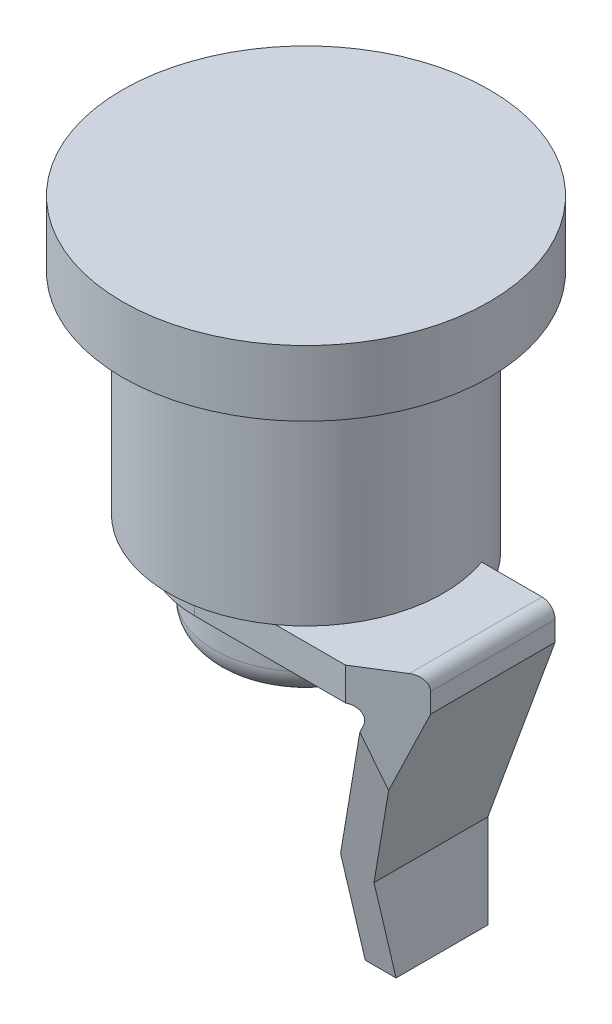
from build123d import *

# Parameters (mm, degrees)
SKETCH1_R           = 14
BOSS_EXTRUDE1_DEPTH = 5
SKETCH2_R           = 10.5
BOSS_EXTRUDE2_DEPTH = 16
SKETCH3_R           = 8.5
BOSS_EXTRUDE3_DEPTH = 2.5
SKETCH4_R           = 7
BOSS_EXTRUDE4_DEPTH = 5
FILLET1_R           = 2
BOSS_EXTRUDE5_START = -2.5
BOSS_EXTRUDE5_DEPTH = 2.5
BOSS_EXTRUDE7_DEPTH = 17
FILLET3_R           = 1
CUT_EXTRUDE1_REACH  = 53.435
CUT_EXTRUDE2_DEPTH  = 20
SKETCH10_W          = 8.800813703
SKETCH10_H          = 15.870840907
CUT_EXTRUDE3_DEPTH  = 10


with BuildPart() as part:
    # Sketch1 → Boss-Extrude1 (new body)
    with BuildSketch(Plane(origin=(0, 0, 0), x_dir=(1, 0, 0), z_dir=(0, 1, 0))):
        with Locations(Location((0, 0, 0), (0, 0, 270))):
            Circle(SKETCH1_R)
    extrude(amount=BOSS_EXTRUDE1_DEPTH)

    # Sketch2 → Boss-Extrude2 (add)
    with BuildSketch(Plane.XZ):
        with Locations(Location((0, 0, 0), (0, 0, 270))):
            Circle(SKETCH2_R)
    extrude(amount=BOSS_EXTRUDE2_DEPTH)

    # Sketch3 → Boss-Extrude3 (add)
    with BuildSketch(Plane.XZ.offset(16)):
        with Locations(Location((0, 0, 0), (0, 0, 270))):
            Circle(SKETCH3_R)
    extrude(amount=BOSS_EXTRUDE3_DEPTH)

    # Sketch4 → Boss-Extrude4 (add)
    with BuildSketch(Plane.XZ.offset(18.5)):
        with Locations(Location((0, 0, 0), (0, 0, 270))):
            Circle(SKETCH4_R)
    extrude(amount=BOSS_EXTRUDE4_DEPTH)

    # Fillet1
    fillet1_edges = [part.edges().sort_by_distance(p)[0] for p in [
        (0, -23.5, 7),
    ]]
    fillet(fillet1_edges, radius=FILLET1_R)

    # Sketch5 → Boss-Extrude5 (add)
    with BuildSketch(Plane.XZ.offset(18.5).offset(BOSS_EXTRUDE5_START)):
        with BuildLine():
            Line((15.5, 8.5), (0, 8.5))
            ThreePointArc((0, 8.5), (6.01040764, 6.01040764), (8.5, 0))
            ThreePointArc((8.5, 0), (6.01040764, -6.01040764), (0, -8.5))
            Line((0, -8.5), (15.5, -8.5))
            Line((15.5, -8.5), (15.5, 8.5))
        make_face()
    extrude(amount=BOSS_EXTRUDE5_DEPTH)

    # Sketch7 → Boss-Extrude7 (add)
    with BuildSketch(Plane.XY.offset(8.5)):
        Polygon((15.5, -18.5), (10.36969785, -32.595389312), (10.36969785, -39.740338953), (8.020466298, -39.740338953), (8.020466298, -31.740338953), (12.839555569, -18.5), align=None)
    extrude(amount=-BOSS_EXTRUDE7_DEPTH)

    # Fillet3
    fillet3_edges = [part.edges().sort_by_distance(p)[0] for p in [
        (15.5, -16, 0),
        (12.839555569, -18.5, 0),
    ]]
    fillet(fillet3_edges, radius=FILLET3_R)

    # Cut-Extrude1: up to this face of the body (flat: up to its plane)
    cut_extrude1_end = Plane(part.part.faces().sort_by_distance((8.020466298, -35.740338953, 0))[0])
    # Sketch8 → Cut-Extrude1 (cut, up to the picked face)
    with BuildSketch(Plane(origin=(15.5, 0, 0), x_dir=(0, 0, -1), z_dir=(1, 0, 0)), mode=Mode.PRIVATE) as cut_extrude1_sk1:
        Polygon((-3.5, -39.740338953), (-8.5, -18.5), (-8.5, -32.595389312), (-8.5, -39.740338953), align=None)
    cut_extrude1_tool1 = split(extrude(cut_extrude1_sk1.sketch, amount=-CUT_EXTRUDE1_REACH, mode=Mode.PRIVATE), bisect_by=cut_extrude1_end, keep=Keep.BOTH, mode=Mode.PRIVATE)
    # Sketch8 → Cut-Extrude1 (cut, up to the picked face)
    with BuildSketch(Plane(origin=(15.5, 0, 0), x_dir=(0, 0, -1), z_dir=(1, 0, 0)), mode=Mode.PRIVATE) as cut_extrude1_sk2:
        Polygon((8.5, -32.595389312), (8.5, -18.5), (3.5, -39.740338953), (8.5, -39.740338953), align=None)
    cut_extrude1_tool2 = split(extrude(cut_extrude1_sk2.sketch, amount=-CUT_EXTRUDE1_REACH, mode=Mode.PRIVATE), bisect_by=cut_extrude1_end, keep=Keep.BOTH, mode=Mode.PRIVATE)
    add(cut_extrude1_tool1.solids().sort_by(Axis((15.5, -32.660226, 6.833333), (-1, 0, 0)))[0], mode=Mode.SUBTRACT)
    add(cut_extrude1_tool2.solids().sort_by(Axis((15.5, -32.660226, -6.833333), (-1, 0, 0)))[0], mode=Mode.SUBTRACT)

    # Sketch9 → Cut-Extrude2 (cut)
    with BuildSketch(Plane(origin=(0, -16, 0), x_dir=(1, 0, 0), z_dir=(0, 1, 0))):
        Polygon((14.5, 8.5), (14.5, 6.625), (15.5, 6), (15.5, 8.5), align=None)
        Polygon((14.5, 8.5), (11.5, 8.5), (14.5, 6.625), align=None)
        Polygon((14.5, -6.625), (14.5, -8.5), (15.5, -8.5), (15.5, -6), align=None)
        Polygon((14.5, -6.625), (11.5, -8.5), (14.5, -8.5), align=None)
        Polygon((14.5, 6.625), (14.5, 3.5), (15.5, 3.5), (15.5, 6), align=None)
        Polygon((11.5, 8.5), (11.5, 3.5), (14.5, 3.5), (14.5, 6.625), align=None)
        with BuildLine():
            ThreePointArc((6.164414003, 8.5), (8.412032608, 6.283924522), (9.899494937, 3.5))
            Line((9.899494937, 3.5), (10.36969785, 3.5))
            Line((10.36969785, 3.5), (11.5, 3.5))
            Line((11.5, 3.5), (11.5, 8.5))
            Line((11.5, 8.5), (6.164414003, 8.5))
        make_face()
    extrude(amount=-CUT_EXTRUDE2_DEPTH, mode=Mode.SUBTRACT)

    # Sketch10 → Cut-Extrude3 (cut)
    with BuildSketch(Plane(origin=(10.36969785, 0, 0), x_dir=(0, 0, -1), z_dir=(1, 0, 0))):
        with Locations((7.900406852, -31.8049185)):
            Rectangle(SKETCH10_W, SKETCH10_H)
    extrude(amount=-CUT_EXTRUDE3_DEPTH, mode=Mode.SUBTRACT)


solid = part.part
